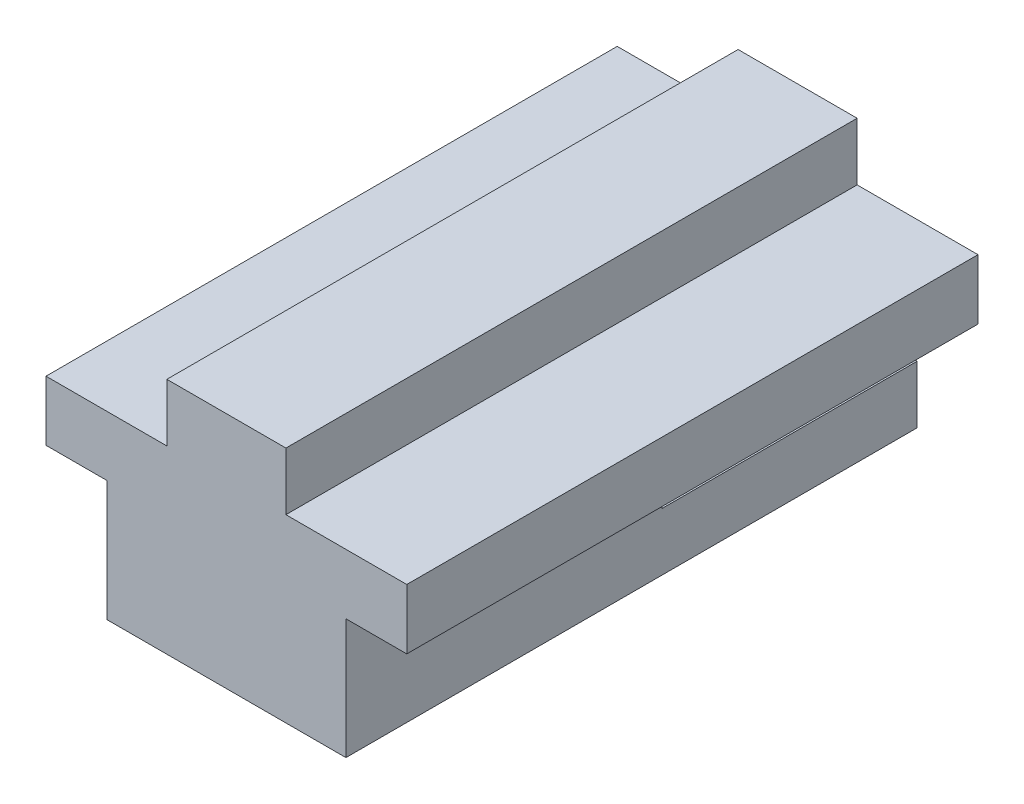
from build123d import *

# Parameters (mm, degrees)
BOSS_EXTRUDE1_DEPTH              = 60.325
SKETCH3_R                        = 2.3876
CUT_EXTRUDE1_DEPTH               = 6.35
F_10_32_TAPPED_HOLE1_D           = 4.0386
F_10_32_TAPPED_HOLE1_DEPTH       = 11.938
F_10_32_TAPPED_HOLE1_CSINK_D     = 6.096
F_10_32_TAPPED_HOLE1_CSINK_ANGLE = 90
F_10_32_TAPPED_HOLE1_TIP         = 1.213317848
CUT_EXTRUDE2_DEPTH               = 70.308190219
CUT_EXTRUDE2_DEPTH_BACK          = 70.308190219
SKETCH6_W                        = 26.924
SKETCH6_H                        = 6.604


with BuildPart() as part:
    # Sketch2 → Boss-Extrude1 (new body)
    with BuildSketch(Plane.XY):
        Polygon((26.9748, 0), (33.401, 0), (33.401, 6.35), (20.6375, 6.35), (20.6375, 12.446), (8.0645, 12.446), (8.0645, 6.35), (-4.699, 6.35), (-4.699, 0.0254), (1.7272, 0.0254), (1.7272, -12.7), (26.9748, -12.7), align=None)
    extrude(amount=-BOSS_EXTRUDE1_DEPTH)

    # Sketch3 → Cut-Extrude1 (cut)
    with BuildSketch(Plane.XZ.offset(12.7)):
        with Locations((8.001, -15.875)):
            Circle(SKETCH3_R)
        with Locations((20.701, -15.875)):
            Circle(SKETCH3_R)
    extrude(amount=-CUT_EXTRUDE1_DEPTH, mode=Mode.SUBTRACT)

    # 10-32 Tapped Hole1
    with Locations(Plane(origin=(0, -12.7, 0), x_dir=(-1, 0, 0), z_dir=(0, -1, 0))):
        with Locations((-14.351, 4.7625), (-14.351, 26.9875)):
            CounterSinkHole(F_10_32_TAPPED_HOLE1_D / 2, F_10_32_TAPPED_HOLE1_CSINK_D / 2, depth=F_10_32_TAPPED_HOLE1_DEPTH, counter_sink_angle=F_10_32_TAPPED_HOLE1_CSINK_ANGLE)
            with Locations((0, 0, -(F_10_32_TAPPED_HOLE1_DEPTH + F_10_32_TAPPED_HOLE1_TIP / 2))):  # 118° drill point
                Cone(0, F_10_32_TAPPED_HOLE1_D / 2, F_10_32_TAPPED_HOLE1_TIP, mode=Mode.SUBTRACT)

    # Sketch6 → Cut-Extrude2 (cut, two sides: drawn at the far end of the back side and taken through both)
    with BuildSketch(Plane.ZY.offset(-1.7272).offset(-CUT_EXTRUDE2_DEPTH_BACK)):
        with Locations((-46.863, -3.302)):
            Rectangle(SKETCH6_W, SKETCH6_H)
    extrude(amount=CUT_EXTRUDE2_DEPTH + CUT_EXTRUDE2_DEPTH_BACK, mode=Mode.SUBTRACT)


solid = part.part
